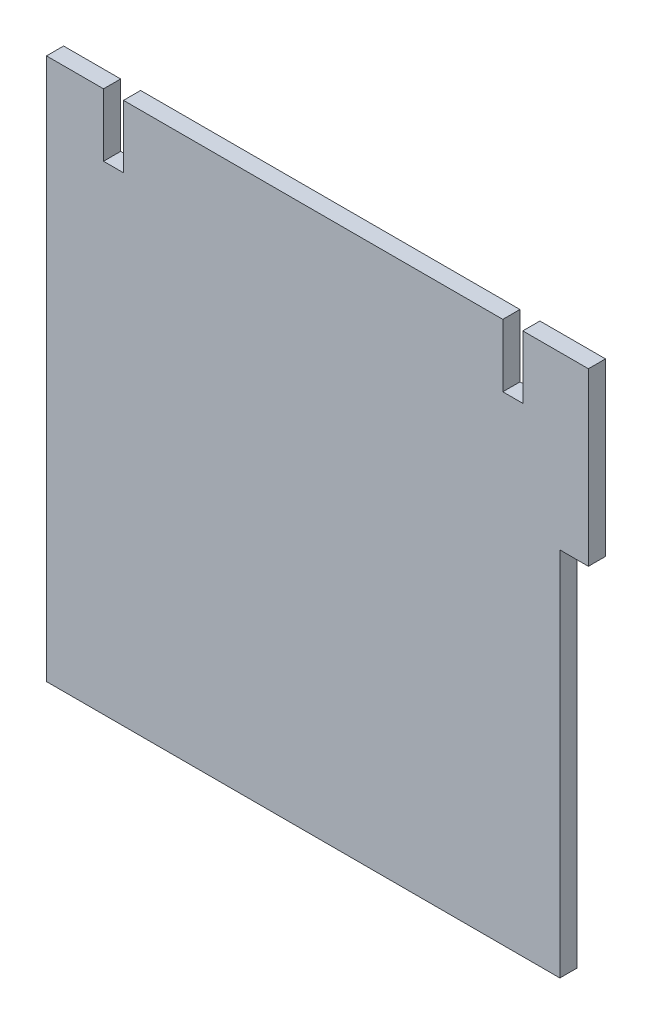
ISO-10303-21;
HEADER;
FILE_DESCRIPTION(('STEP AP214'),'2;1');
FILE_NAME('part.step','',(''),(''),'','','');
FILE_SCHEMA(('AUTOMOTIVE_DESIGN { 1 0 10303 214 1 1 1 1 }'));
ENDSEC;
DATA;
#1=APPLICATION_CONTEXT('core data for automotive mechanical design processes');
#2=APPLICATION_PROTOCOL_DEFINITION('international standard','automotive_design',2000,#1);
#3=PRODUCT_CONTEXT('',#1,'mechanical');
#4=PRODUCT('Part','Part','',(#3));
#5=PRODUCT_RELATED_PRODUCT_CATEGORY('part','',(#4));
#6=PRODUCT_DEFINITION_FORMATION('','',#4);
#7=PRODUCT_DEFINITION_CONTEXT('part definition',#1,'design');
#8=PRODUCT_DEFINITION('design','',#6,#7);
#9=PRODUCT_DEFINITION_SHAPE('','',#8);
#10=(LENGTH_UNIT() NAMED_UNIT(*) SI_UNIT(.MILLI.,.METRE.));
#11=(NAMED_UNIT(*) PLANE_ANGLE_UNIT() SI_UNIT($,.RADIAN.));
#12=(NAMED_UNIT(*) SI_UNIT($,.STERADIAN.) SOLID_ANGLE_UNIT());
#13=UNCERTAINTY_MEASURE_WITH_UNIT(LENGTH_MEASURE(1.E-05),#10,'distance_accuracy_value','');
#14=(GEOMETRIC_REPRESENTATION_CONTEXT(3) GLOBAL_UNCERTAINTY_ASSIGNED_CONTEXT((#13)) GLOBAL_UNIT_ASSIGNED_CONTEXT((#10,
#11,#12)) REPRESENTATION_CONTEXT('',''));
#15=CARTESIAN_POINT('',(0.,0.,0.));
#16=DIRECTION('',(0.,0.,1.));
#17=DIRECTION('',(1.,0.,0.));
#18=AXIS2_PLACEMENT_3D('',#15,#16,#17);
#19=CARTESIAN_POINT('',(0.,95.,3.));
#20=DIRECTION('',(0.,-1.,0.));
#21=DIRECTION('',(0.,0.,-1.));
#22=AXIS2_PLACEMENT_3D('',#19,#20,#21);
#23=PLANE('',#22);
#24=DIRECTION('',(-1.,0.,0.));
#25=VECTOR('',#24,1.);
#26=CARTESIAN_POINT('',(0.,95.,3.));
#27=LINE('',#26,#25);
#28=CARTESIAN_POINT('',(80.,95.,3.));
#29=VERTEX_POINT('',#28);
#30=CARTESIAN_POINT('',(13.5,95.,3.));
#31=VERTEX_POINT('',#30);
#32=EDGE_CURVE('E176',#29,#31,#27,.T.);
#33=ORIENTED_EDGE('',*,*,#32,.F.);
#34=DIRECTION('',(0.,0.,1.));
#35=VECTOR('',#34,1.);
#36=CARTESIAN_POINT('',(80.,95.,0.));
#37=LINE('',#36,#35);
#38=CARTESIAN_POINT('',(80.,95.,0.));
#39=VERTEX_POINT('',#38);
#40=EDGE_CURVE('E209',#39,#29,#37,.T.);
#41=ORIENTED_EDGE('',*,*,#40,.F.);
#42=DIRECTION('',(-1.,0.,0.));
#43=VECTOR('',#42,1.);
#44=CARTESIAN_POINT('',(0.,95.,0.));
#45=LINE('',#44,#43);
#46=CARTESIAN_POINT('',(13.5,95.,0.));
#47=VERTEX_POINT('',#46);
#48=EDGE_CURVE('E157',#39,#47,#45,.T.);
#49=ORIENTED_EDGE('',*,*,#48,.T.);
#50=DIRECTION('',(0.,0.,1.));
#51=VECTOR('',#50,1.);
#52=CARTESIAN_POINT('',(13.5,95.,0.));
#53=LINE('',#52,#51);
#54=EDGE_CURVE('E194',#47,#31,#53,.T.);
#55=ORIENTED_EDGE('',*,*,#54,.T.);
#56=EDGE_LOOP('',(#33,#41,#49,#55));
#57=FACE_BOUND('',#56,.T.);
#58=ADVANCED_FACE('F31',(#57),#23,.F.);
#59=CARTESIAN_POINT('',(10.,95.,3.));
#60=VERTEX_POINT('',#59);
#61=CARTESIAN_POINT('',(0.,95.,3.));
#62=VERTEX_POINT('',#61);
#63=EDGE_CURVE('E178',#60,#62,#27,.T.);
#64=ORIENTED_EDGE('',*,*,#63,.F.);
#65=DIRECTION('',(0.,0.,1.));
#66=VECTOR('',#65,1.);
#67=CARTESIAN_POINT('',(10.,95.,0.));
#68=LINE('',#67,#66);
#69=CARTESIAN_POINT('',(10.,95.,0.));
#70=VERTEX_POINT('',#69);
#71=EDGE_CURVE('E197',#70,#60,#68,.T.);
#72=ORIENTED_EDGE('',*,*,#71,.F.);
#73=CARTESIAN_POINT('',(0.,95.,0.));
#74=VERTEX_POINT('',#73);
#75=EDGE_CURVE('E154',#70,#74,#45,.T.);
#76=ORIENTED_EDGE('',*,*,#75,.T.);
#77=DIRECTION('',(0.,0.,-1.));
#78=VECTOR('',#77,1.);
#79=CARTESIAN_POINT('',(0.,95.,3.));
#80=LINE('',#79,#78);
#81=EDGE_CURVE('E165',#62,#74,#80,.T.);
#82=ORIENTED_EDGE('',*,*,#81,.F.);
#83=EDGE_LOOP('',(#64,#72,#76,#82));
#84=FACE_BOUND('',#83,.T.);
#85=ADVANCED_FACE('F255',(#84),#23,.F.);
#86=CARTESIAN_POINT('',(0.,0.,3.));
#87=DIRECTION('',(1.,0.,0.));
#88=DIRECTION('',(0.,0.,-1.));
#89=AXIS2_PLACEMENT_3D('',#86,#87,#88);
#90=PLANE('',#89);
#91=DIRECTION('',(0.,-1.,0.));
#92=VECTOR('',#91,1.);
#93=CARTESIAN_POINT('',(0.,0.,0.));
#94=LINE('',#93,#92);
#95=CARTESIAN_POINT('',(0.,0.,0.));
#96=VERTEX_POINT('',#95);
#97=EDGE_CURVE('E160',#74,#96,#94,.T.);
#98=ORIENTED_EDGE('',*,*,#97,.T.);
#99=DIRECTION('',(0.,0.,-1.));
#100=VECTOR('',#99,1.);
#101=CARTESIAN_POINT('',(0.,0.,3.));
#102=LINE('',#101,#100);
#103=CARTESIAN_POINT('',(0.,0.,3.));
#104=VERTEX_POINT('',#103);
#105=EDGE_CURVE('E11',#104,#96,#102,.T.);
#106=ORIENTED_EDGE('',*,*,#105,.F.);
#107=DIRECTION('',(0.,-1.,0.));
#108=VECTOR('',#107,1.);
#109=CARTESIAN_POINT('',(0.,0.,3.));
#110=LINE('',#109,#108);
#111=EDGE_CURVE('E164',#62,#104,#110,.T.);
#112=ORIENTED_EDGE('',*,*,#111,.F.);
#113=ORIENTED_EDGE('',*,*,#81,.T.);
#114=EDGE_LOOP('',(#98,#106,#112,#113));
#115=FACE_BOUND('',#114,.T.);
#116=ADVANCED_FACE('F33',(#115),#90,.F.);
#117=CARTESIAN_POINT('',(0.,0.,3.));
#118=DIRECTION('',(0.,1.,0.));
#119=DIRECTION('',(0.,0.,1.));
#120=AXIS2_PLACEMENT_3D('',#117,#118,#119);
#121=PLANE('',#120);
#122=DIRECTION('',(1.,0.,0.));
#123=VECTOR('',#122,1.);
#124=CARTESIAN_POINT('',(0.,0.,0.));
#125=LINE('',#124,#123);
#126=CARTESIAN_POINT('',(90.,0.,0.));
#127=VERTEX_POINT('',#126);
#128=EDGE_CURVE('E155',#96,#127,#125,.T.);
#129=ORIENTED_EDGE('',*,*,#128,.T.);
#130=DIRECTION('',(0.,0.,1.));
#131=VECTOR('',#130,1.);
#132=CARTESIAN_POINT('',(90.,0.,0.));
#133=LINE('',#132,#131);
#134=CARTESIAN_POINT('',(90.,0.,3.));
#135=VERTEX_POINT('',#134);
#136=EDGE_CURVE('E232',#127,#135,#133,.T.);
#137=ORIENTED_EDGE('',*,*,#136,.T.);
#138=DIRECTION('',(1.,0.,0.));
#139=VECTOR('',#138,1.);
#140=CARTESIAN_POINT('',(0.,0.,3.));
#141=LINE('',#140,#139);
#142=EDGE_CURVE('E184',#104,#135,#141,.T.);
#143=ORIENTED_EDGE('',*,*,#142,.F.);
#144=ORIENTED_EDGE('',*,*,#105,.T.);
#145=EDGE_LOOP('',(#129,#137,#143,#144));
#146=FACE_BOUND('',#145,.T.);
#147=ADVANCED_FACE('F247',(#146),#121,.F.);
#148=CARTESIAN_POINT('',(95.,0.,3.));
#149=DIRECTION('',(-1.,0.,0.));
#150=DIRECTION('',(0.,0.,1.));
#151=AXIS2_PLACEMENT_3D('',#148,#149,#150);
#152=PLANE('',#151);
#153=DIRECTION('',(0.,1.,0.));
#154=VECTOR('',#153,1.);
#155=CARTESIAN_POINT('',(95.,0.,3.));
#156=LINE('',#155,#154);
#157=CARTESIAN_POINT('',(95.,65.,3.));
#158=VERTEX_POINT('',#157);
#159=CARTESIAN_POINT('',(95.,95.,3.));
#160=VERTEX_POINT('',#159);
#161=EDGE_CURVE('E148',#158,#160,#156,.T.);
#162=ORIENTED_EDGE('',*,*,#161,.F.);
#163=DIRECTION('',(0.,0.,1.));
#164=VECTOR('',#163,1.);
#165=CARTESIAN_POINT('',(95.,65.,0.));
#166=LINE('',#165,#164);
#167=CARTESIAN_POINT('',(95.,65.,0.));
#168=VERTEX_POINT('',#167);
#169=EDGE_CURVE('E135',#168,#158,#166,.T.);
#170=ORIENTED_EDGE('',*,*,#169,.F.);
#171=DIRECTION('',(0.,1.,0.));
#172=VECTOR('',#171,1.);
#173=CARTESIAN_POINT('',(95.,0.,0.));
#174=LINE('',#173,#172);
#175=CARTESIAN_POINT('',(95.,95.,0.));
#176=VERTEX_POINT('',#175);
#177=EDGE_CURVE('E146',#168,#176,#174,.T.);
#178=ORIENTED_EDGE('',*,*,#177,.T.);
#179=DIRECTION('',(0.,0.,-1.));
#180=VECTOR('',#179,1.);
#181=CARTESIAN_POINT('',(95.,95.,3.));
#182=LINE('',#181,#180);
#183=EDGE_CURVE('E39',#160,#176,#182,.T.);
#184=ORIENTED_EDGE('',*,*,#183,.F.);
#185=EDGE_LOOP('',(#162,#170,#178,#184));
#186=FACE_BOUND('',#185,.T.);
#187=ADVANCED_FACE('F144',(#186),#152,.F.);
#188=CARTESIAN_POINT('',(83.5,95.,0.));
#189=VERTEX_POINT('',#188);
#190=EDGE_CURVE('E153',#176,#189,#45,.T.);
#191=ORIENTED_EDGE('',*,*,#190,.T.);
#192=DIRECTION('',(0.,0.,1.));
#193=VECTOR('',#192,1.);
#194=CARTESIAN_POINT('',(83.5,95.,0.));
#195=LINE('',#194,#193);
#196=CARTESIAN_POINT('',(83.5,95.,3.));
#197=VERTEX_POINT('',#196);
#198=EDGE_CURVE('E173',#189,#197,#195,.T.);
#199=ORIENTED_EDGE('',*,*,#198,.T.);
#200=EDGE_CURVE('E167',#160,#197,#27,.T.);
#201=ORIENTED_EDGE('',*,*,#200,.F.);
#202=ORIENTED_EDGE('',*,*,#183,.T.);
#203=EDGE_LOOP('',(#191,#199,#201,#202));
#204=FACE_BOUND('',#203,.T.);
#205=ADVANCED_FACE('F170',(#204),#23,.F.);
#206=CARTESIAN_POINT('',(0.,95.,3.));
#207=DIRECTION('',(0.,0.,-1.));
#208=DIRECTION('',(-1.,0.,0.));
#209=AXIS2_PLACEMENT_3D('',#206,#207,#208);
#210=PLANE('',#209);
#211=ORIENTED_EDGE('',*,*,#142,.T.);
#212=DIRECTION('',(0.,-1.,0.));
#213=VECTOR('',#212,1.);
#214=CARTESIAN_POINT('',(90.,65.,3.));
#215=LINE('',#214,#213);
#216=CARTESIAN_POINT('',(90.,65.,3.));
#217=VERTEX_POINT('',#216);
#218=EDGE_CURVE('E140',#217,#135,#215,.T.);
#219=ORIENTED_EDGE('',*,*,#218,.F.);
#220=DIRECTION('',(-1.,0.,0.));
#221=VECTOR('',#220,1.);
#222=CARTESIAN_POINT('',(95.,65.,3.));
#223=LINE('',#222,#221);
#224=EDGE_CURVE('E243',#158,#217,#223,.T.);
#225=ORIENTED_EDGE('',*,*,#224,.F.);
#226=ORIENTED_EDGE('',*,*,#161,.T.);
#227=ORIENTED_EDGE('',*,*,#200,.T.);
#228=DIRECTION('',(0.,1.,0.));
#229=VECTOR('',#228,1.);
#230=CARTESIAN_POINT('',(83.5,95.,3.));
#231=LINE('',#230,#229);
#232=CARTESIAN_POINT('',(83.5,84.,3.));
#233=VERTEX_POINT('',#232);
#234=EDGE_CURVE('E223',#233,#197,#231,.T.);
#235=ORIENTED_EDGE('',*,*,#234,.F.);
#236=DIRECTION('',(1.,0.,0.));
#237=VECTOR('',#236,1.);
#238=CARTESIAN_POINT('',(80.,84.,3.));
#239=LINE('',#238,#237);
#240=CARTESIAN_POINT('',(80.,84.,3.));
#241=VERTEX_POINT('',#240);
#242=EDGE_CURVE('E226',#241,#233,#239,.T.);
#243=ORIENTED_EDGE('',*,*,#242,.F.);
#244=DIRECTION('',(0.,-1.,0.));
#245=VECTOR('',#244,1.);
#246=CARTESIAN_POINT('',(80.,95.,3.));
#247=LINE('',#246,#245);
#248=EDGE_CURVE('E229',#29,#241,#247,.T.);
#249=ORIENTED_EDGE('',*,*,#248,.F.);
#250=ORIENTED_EDGE('',*,*,#32,.T.);
#251=DIRECTION('',(0.,1.,0.));
#252=VECTOR('',#251,1.);
#253=CARTESIAN_POINT('',(13.5,95.,3.));
#254=LINE('',#253,#252);
#255=CARTESIAN_POINT('',(13.5,84.,3.));
#256=VERTEX_POINT('',#255);
#257=EDGE_CURVE('E199',#256,#31,#254,.T.);
#258=ORIENTED_EDGE('',*,*,#257,.F.);
#259=DIRECTION('',(1.,0.,0.));
#260=VECTOR('',#259,1.);
#261=CARTESIAN_POINT('',(10.,84.,3.));
#262=LINE('',#261,#260);
#263=CARTESIAN_POINT('',(10.,84.,3.));
#264=VERTEX_POINT('',#263);
#265=EDGE_CURVE('E203',#264,#256,#262,.T.);
#266=ORIENTED_EDGE('',*,*,#265,.F.);
#267=DIRECTION('',(0.,-1.,0.));
#268=VECTOR('',#267,1.);
#269=CARTESIAN_POINT('',(10.,95.,3.));
#270=LINE('',#269,#268);
#271=EDGE_CURVE('E206',#60,#264,#270,.T.);
#272=ORIENTED_EDGE('',*,*,#271,.F.);
#273=ORIENTED_EDGE('',*,*,#63,.T.);
#274=ORIENTED_EDGE('',*,*,#111,.T.);
#275=EDGE_LOOP('',(#211,#219,#225,#226,#227,#235,#243,#249,#250,#258,#266,#272,#273,#274));
#276=FACE_BOUND('',#275,.T.);
#277=ADVANCED_FACE('F259',(#276),#210,.F.);
#278=CARTESIAN_POINT('',(0.,95.,0.));
#279=DIRECTION('',(0.,0.,-1.));
#280=DIRECTION('',(-1.,0.,0.));
#281=AXIS2_PLACEMENT_3D('',#278,#279,#280);
#282=PLANE('',#281);
#283=DIRECTION('',(0.,-1.,0.));
#284=VECTOR('',#283,1.);
#285=CARTESIAN_POINT('',(90.,65.,0.));
#286=LINE('',#285,#284);
#287=CARTESIAN_POINT('',(90.,65.,0.));
#288=VERTEX_POINT('',#287);
#289=EDGE_CURVE('E46',#288,#127,#286,.T.);
#290=ORIENTED_EDGE('',*,*,#289,.T.);
#291=ORIENTED_EDGE('',*,*,#128,.F.);
#292=ORIENTED_EDGE('',*,*,#97,.F.);
#293=ORIENTED_EDGE('',*,*,#75,.F.);
#294=DIRECTION('',(0.,-1.,0.));
#295=VECTOR('',#294,1.);
#296=CARTESIAN_POINT('',(10.,95.,0.));
#297=LINE('',#296,#295);
#298=CARTESIAN_POINT('',(10.,84.,0.));
#299=VERTEX_POINT('',#298);
#300=EDGE_CURVE('E202',#70,#299,#297,.T.);
#301=ORIENTED_EDGE('',*,*,#300,.T.);
#302=DIRECTION('',(1.,0.,0.));
#303=VECTOR('',#302,1.);
#304=CARTESIAN_POINT('',(10.,84.,0.));
#305=LINE('',#304,#303);
#306=CARTESIAN_POINT('',(13.5,84.,0.));
#307=VERTEX_POINT('',#306);
#308=EDGE_CURVE('E212',#299,#307,#305,.T.);
#309=ORIENTED_EDGE('',*,*,#308,.T.);
#310=DIRECTION('',(0.,1.,0.));
#311=VECTOR('',#310,1.);
#312=CARTESIAN_POINT('',(13.5,95.,0.));
#313=LINE('',#312,#311);
#314=EDGE_CURVE('E192',#307,#47,#313,.T.);
#315=ORIENTED_EDGE('',*,*,#314,.T.);
#316=ORIENTED_EDGE('',*,*,#48,.F.);
#317=DIRECTION('',(0.,-1.,0.));
#318=VECTOR('',#317,1.);
#319=CARTESIAN_POINT('',(80.,95.,0.));
#320=LINE('',#319,#318);
#321=CARTESIAN_POINT('',(80.,84.,0.));
#322=VERTEX_POINT('',#321);
#323=EDGE_CURVE('E225',#39,#322,#320,.T.);
#324=ORIENTED_EDGE('',*,*,#323,.T.);
#325=DIRECTION('',(1.,0.,0.));
#326=VECTOR('',#325,1.);
#327=CARTESIAN_POINT('',(80.,84.,0.));
#328=LINE('',#327,#326);
#329=CARTESIAN_POINT('',(83.5,84.,0.));
#330=VERTEX_POINT('',#329);
#331=EDGE_CURVE('E234',#322,#330,#328,.T.);
#332=ORIENTED_EDGE('',*,*,#331,.T.);
#333=DIRECTION('',(0.,1.,0.));
#334=VECTOR('',#333,1.);
#335=CARTESIAN_POINT('',(83.5,95.,0.));
#336=LINE('',#335,#334);
#337=EDGE_CURVE('E54',#330,#189,#336,.T.);
#338=ORIENTED_EDGE('',*,*,#337,.T.);
#339=ORIENTED_EDGE('',*,*,#190,.F.);
#340=ORIENTED_EDGE('',*,*,#177,.F.);
#341=DIRECTION('',(-1.,0.,0.));
#342=VECTOR('',#341,1.);
#343=CARTESIAN_POINT('',(95.,65.,0.));
#344=LINE('',#343,#342);
#345=EDGE_CURVE('E131',#168,#288,#344,.T.);
#346=ORIENTED_EDGE('',*,*,#345,.T.);
#347=EDGE_LOOP('',(#290,#291,#292,#293,#301,#309,#315,#316,#324,#332,#338,#339,#340,#346));
#348=FACE_BOUND('',#347,.T.);
#349=ADVANCED_FACE('F151',(#348),#282,.T.);
#350=CARTESIAN_POINT('',(10.,95.,0.));
#351=DIRECTION('',(-1.,0.,0.));
#352=DIRECTION('',(0.,-1.,0.));
#353=AXIS2_PLACEMENT_3D('',#350,#351,#352);
#354=PLANE('',#353);
#355=ORIENTED_EDGE('',*,*,#271,.T.);
#356=DIRECTION('',(0.,0.,1.));
#357=VECTOR('',#356,1.);
#358=CARTESIAN_POINT('',(10.,84.,0.));
#359=LINE('',#358,#357);
#360=EDGE_CURVE('E189',#299,#264,#359,.T.);
#361=ORIENTED_EDGE('',*,*,#360,.F.);
#362=ORIENTED_EDGE('',*,*,#300,.F.);
#363=ORIENTED_EDGE('',*,*,#71,.T.);
#364=EDGE_LOOP('',(#355,#361,#362,#363));
#365=FACE_BOUND('',#364,.T.);
#366=ADVANCED_FACE('F257',(#365),#354,.F.);
#367=CARTESIAN_POINT('',(13.5,95.,0.));
#368=DIRECTION('',(1.,0.,0.));
#369=DIRECTION('',(0.,1.,0.));
#370=AXIS2_PLACEMENT_3D('',#367,#368,#369);
#371=PLANE('',#370);
#372=ORIENTED_EDGE('',*,*,#257,.T.);
#373=ORIENTED_EDGE('',*,*,#54,.F.);
#374=ORIENTED_EDGE('',*,*,#314,.F.);
#375=DIRECTION('',(0.,0.,1.));
#376=VECTOR('',#375,1.);
#377=CARTESIAN_POINT('',(13.5,84.,0.));
#378=LINE('',#377,#376);
#379=EDGE_CURVE('E191',#307,#256,#378,.T.);
#380=ORIENTED_EDGE('',*,*,#379,.T.);
#381=EDGE_LOOP('',(#372,#373,#374,#380));
#382=FACE_BOUND('',#381,.T.);
#383=ADVANCED_FACE('F268',(#382),#371,.F.);
#384=CARTESIAN_POINT('',(10.,84.,0.));
#385=DIRECTION('',(0.,-1.,0.));
#386=DIRECTION('',(0.,0.,-1.));
#387=AXIS2_PLACEMENT_3D('',#384,#385,#386);
#388=PLANE('',#387);
#389=ORIENTED_EDGE('',*,*,#265,.T.);
#390=ORIENTED_EDGE('',*,*,#379,.F.);
#391=ORIENTED_EDGE('',*,*,#308,.F.);
#392=ORIENTED_EDGE('',*,*,#360,.T.);
#393=EDGE_LOOP('',(#389,#390,#391,#392));
#394=FACE_BOUND('',#393,.T.);
#395=ADVANCED_FACE('F263',(#394),#388,.F.);
#396=CARTESIAN_POINT('',(80.,95.,0.));
#397=DIRECTION('',(-1.,0.,0.));
#398=DIRECTION('',(0.,0.,1.));
#399=AXIS2_PLACEMENT_3D('',#396,#397,#398);
#400=PLANE('',#399);
#401=ORIENTED_EDGE('',*,*,#248,.T.);
#402=DIRECTION('',(0.,0.,1.));
#403=VECTOR('',#402,1.);
#404=CARTESIAN_POINT('',(80.,84.,0.));
#405=LINE('',#404,#403);
#406=EDGE_CURVE('E217',#322,#241,#405,.T.);
#407=ORIENTED_EDGE('',*,*,#406,.F.);
#408=ORIENTED_EDGE('',*,*,#323,.F.);
#409=ORIENTED_EDGE('',*,*,#40,.T.);
#410=EDGE_LOOP('',(#401,#407,#408,#409));
#411=FACE_BOUND('',#410,.T.);
#412=ADVANCED_FACE('F274',(#411),#400,.F.);
#413=CARTESIAN_POINT('',(83.5,95.,0.));
#414=DIRECTION('',(1.,0.,0.));
#415=DIRECTION('',(0.,0.,-1.));
#416=AXIS2_PLACEMENT_3D('',#413,#414,#415);
#417=PLANE('',#416);
#418=ORIENTED_EDGE('',*,*,#234,.T.);
#419=ORIENTED_EDGE('',*,*,#198,.F.);
#420=ORIENTED_EDGE('',*,*,#337,.F.);
#421=DIRECTION('',(0.,0.,1.));
#422=VECTOR('',#421,1.);
#423=CARTESIAN_POINT('',(83.5,84.,0.));
#424=LINE('',#423,#422);
#425=EDGE_CURVE('E219',#330,#233,#424,.T.);
#426=ORIENTED_EDGE('',*,*,#425,.T.);
#427=EDGE_LOOP('',(#418,#419,#420,#426));
#428=FACE_BOUND('',#427,.T.);
#429=ADVANCED_FACE('F279',(#428),#417,.F.);
#430=CARTESIAN_POINT('',(80.,84.,0.));
#431=DIRECTION('',(0.,-1.,0.));
#432=DIRECTION('',(0.,0.,-1.));
#433=AXIS2_PLACEMENT_3D('',#430,#431,#432);
#434=PLANE('',#433);
#435=ORIENTED_EDGE('',*,*,#242,.T.);
#436=ORIENTED_EDGE('',*,*,#425,.F.);
#437=ORIENTED_EDGE('',*,*,#331,.F.);
#438=ORIENTED_EDGE('',*,*,#406,.T.);
#439=EDGE_LOOP('',(#435,#436,#437,#438));
#440=FACE_BOUND('',#439,.T.);
#441=ADVANCED_FACE('F277',(#440),#434,.F.);
#442=CARTESIAN_POINT('',(90.,65.,0.));
#443=DIRECTION('',(-1.,0.,0.));
#444=DIRECTION('',(0.,-1.,0.));
#445=AXIS2_PLACEMENT_3D('',#442,#443,#444);
#446=PLANE('',#445);
#447=ORIENTED_EDGE('',*,*,#218,.T.);
#448=ORIENTED_EDGE('',*,*,#136,.F.);
#449=ORIENTED_EDGE('',*,*,#289,.F.);
#450=DIRECTION('',(0.,0.,1.));
#451=VECTOR('',#450,1.);
#452=CARTESIAN_POINT('',(90.,65.,0.));
#453=LINE('',#452,#451);
#454=EDGE_CURVE('E137',#288,#217,#453,.T.);
#455=ORIENTED_EDGE('',*,*,#454,.T.);
#456=EDGE_LOOP('',(#447,#448,#449,#455));
#457=FACE_BOUND('',#456,.T.);
#458=ADVANCED_FACE('F286',(#457),#446,.F.);
#459=CARTESIAN_POINT('',(95.,65.,0.));
#460=DIRECTION('',(0.,1.,0.));
#461=DIRECTION('',(0.,0.,1.));
#462=AXIS2_PLACEMENT_3D('',#459,#460,#461);
#463=PLANE('',#462);
#464=ORIENTED_EDGE('',*,*,#224,.T.);
#465=ORIENTED_EDGE('',*,*,#454,.F.);
#466=ORIENTED_EDGE('',*,*,#345,.F.);
#467=ORIENTED_EDGE('',*,*,#169,.T.);
#468=EDGE_LOOP('',(#464,#465,#466,#467));
#469=FACE_BOUND('',#468,.T.);
#470=ADVANCED_FACE('F134',(#469),#463,.F.);
#471=CLOSED_SHELL('',(#58,#85,#116,#147,#187,#205,#277,#349,#366,#383,#395,#412,#429,#441,#458,#470));
#472=MANIFOLD_SOLID_BREP('B2',#471);
#473=ADVANCED_BREP_SHAPE_REPRESENTATION('',(#18,#472),#14);
#474=SHAPE_DEFINITION_REPRESENTATION(#9,#473);
ENDSEC;
END-ISO-10303-21;
